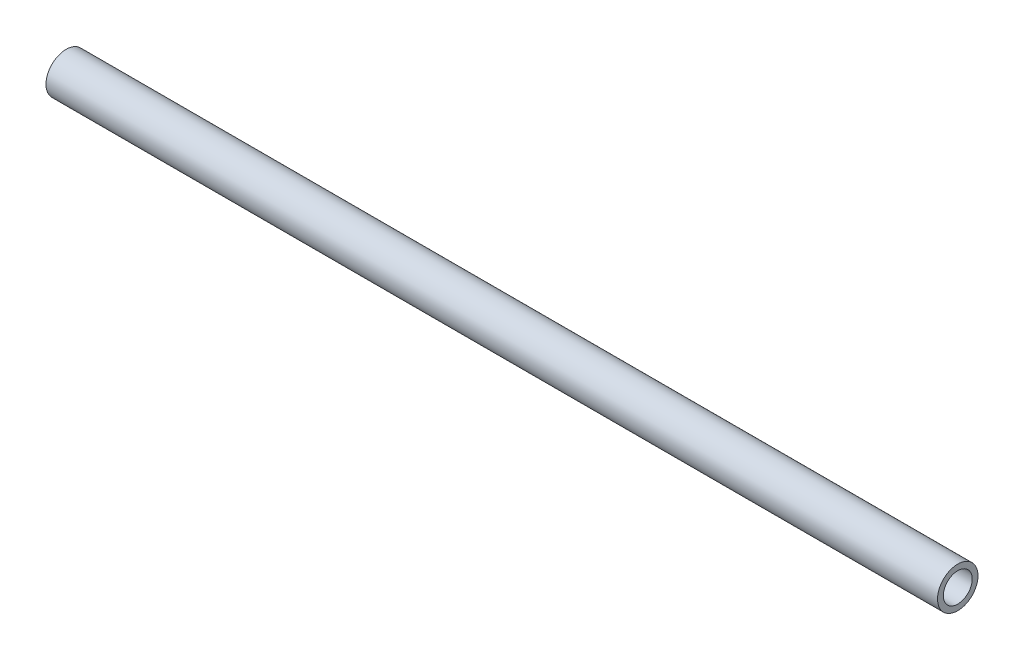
ISO-10303-21;
HEADER;
FILE_DESCRIPTION(('STEP AP214'),'2;1');
FILE_NAME('part.step','',(''),(''),'','','');
FILE_SCHEMA(('AUTOMOTIVE_DESIGN { 1 0 10303 214 1 1 1 1 }'));
ENDSEC;
DATA;
#1=APPLICATION_CONTEXT('core data for automotive mechanical design processes');
#2=APPLICATION_PROTOCOL_DEFINITION('international standard','automotive_design',2000,#1);
#3=PRODUCT_CONTEXT('',#1,'mechanical');
#4=PRODUCT('Part','Part','',(#3));
#5=PRODUCT_RELATED_PRODUCT_CATEGORY('part','',(#4));
#6=PRODUCT_DEFINITION_FORMATION('','',#4);
#7=PRODUCT_DEFINITION_CONTEXT('part definition',#1,'design');
#8=PRODUCT_DEFINITION('design','',#6,#7);
#9=PRODUCT_DEFINITION_SHAPE('','',#8);
#10=(LENGTH_UNIT() NAMED_UNIT(*) SI_UNIT(.MILLI.,.METRE.));
#11=(NAMED_UNIT(*) PLANE_ANGLE_UNIT() SI_UNIT($,.RADIAN.));
#12=(NAMED_UNIT(*) SI_UNIT($,.STERADIAN.) SOLID_ANGLE_UNIT());
#13=UNCERTAINTY_MEASURE_WITH_UNIT(LENGTH_MEASURE(1.E-05),#10,'distance_accuracy_value','');
#14=(GEOMETRIC_REPRESENTATION_CONTEXT(3) GLOBAL_UNCERTAINTY_ASSIGNED_CONTEXT((#13)) GLOBAL_UNIT_ASSIGNED_CONTEXT((#10,
#11,#12)) REPRESENTATION_CONTEXT('',''));
#15=CARTESIAN_POINT('',(0.,0.,0.));
#16=DIRECTION('',(0.,0.,1.));
#17=DIRECTION('',(1.,0.,0.));
#18=AXIS2_PLACEMENT_3D('',#15,#16,#17);
#19=CARTESIAN_POINT('',(469.9,0.,0.));
#20=DIRECTION('',(-1.,0.,0.));
#21=DIRECTION('',(0.,0.,1.));
#22=AXIS2_PLACEMENT_3D('',#19,#20,#21);
#23=CYLINDRICAL_SURFACE('',#22,7.62);
#24=CARTESIAN_POINT('',(469.9,0.,0.));
#25=DIRECTION('',(1.,0.,0.));
#26=DIRECTION('',(0.,0.,-1.));
#27=AXIS2_PLACEMENT_3D('',#24,#25,#26);
#28=CIRCLE('',#27,7.62);
#29=CARTESIAN_POINT('',(469.9,0.,-7.62));
#30=VERTEX_POINT('',#29);
#31=EDGE_CURVE('E53',#30,#30,#28,.T.);
#32=ORIENTED_EDGE('',*,*,#31,.T.);
#33=EDGE_LOOP('',(#32));
#34=FACE_BOUND('',#33,.T.);
#35=CARTESIAN_POINT('',(0.,0.,0.));
#36=DIRECTION('',(1.,0.,0.));
#37=DIRECTION('',(0.,0.,-1.));
#38=AXIS2_PLACEMENT_3D('',#35,#36,#37);
#39=CIRCLE('',#38,7.62);
#40=CARTESIAN_POINT('',(0.,0.,-7.62));
#41=VERTEX_POINT('',#40);
#42=EDGE_CURVE('E60',#41,#41,#39,.T.);
#43=ORIENTED_EDGE('',*,*,#42,.F.);
#44=EDGE_LOOP('',(#43));
#45=FACE_BOUND('',#44,.T.);
#46=ADVANCED_FACE('F45',(#34,#45),#23,.F.);
#47=CARTESIAN_POINT('',(469.9,0.,0.));
#48=DIRECTION('',(-1.,0.,0.));
#49=DIRECTION('',(0.,0.,1.));
#50=AXIS2_PLACEMENT_3D('',#47,#48,#49);
#51=CYLINDRICAL_SURFACE('',#50,10.668);
#52=CARTESIAN_POINT('',(469.9,0.,0.));
#53=DIRECTION('',(1.,0.,0.));
#54=DIRECTION('',(0.,0.,-1.));
#55=AXIS2_PLACEMENT_3D('',#52,#53,#54);
#56=CIRCLE('',#55,10.668);
#57=CARTESIAN_POINT('',(469.9,0.,-10.668));
#58=VERTEX_POINT('',#57);
#59=EDGE_CURVE('E10',#58,#58,#56,.T.);
#60=ORIENTED_EDGE('',*,*,#59,.F.);
#61=EDGE_LOOP('',(#60));
#62=FACE_BOUND('',#61,.T.);
#63=CARTESIAN_POINT('',(0.,0.,0.));
#64=DIRECTION('',(1.,0.,0.));
#65=DIRECTION('',(0.,0.,-1.));
#66=AXIS2_PLACEMENT_3D('',#63,#64,#65);
#67=CIRCLE('',#66,10.668);
#68=CARTESIAN_POINT('',(0.,0.,-10.668));
#69=VERTEX_POINT('',#68);
#70=EDGE_CURVE('E48',#69,#69,#67,.T.);
#71=ORIENTED_EDGE('',*,*,#70,.T.);
#72=EDGE_LOOP('',(#71));
#73=FACE_BOUND('',#72,.T.);
#74=ADVANCED_FACE('F69',(#62,#73),#51,.T.);
#75=CARTESIAN_POINT('',(469.9,0.,0.));
#76=DIRECTION('',(1.,0.,0.));
#77=DIRECTION('',(0.,0.,-1.));
#78=AXIS2_PLACEMENT_3D('',#75,#76,#77);
#79=PLANE('',#78);
#80=ORIENTED_EDGE('',*,*,#31,.F.);
#81=EDGE_LOOP('',(#80));
#82=FACE_BOUND('',#81,.T.);
#83=ORIENTED_EDGE('',*,*,#59,.T.);
#84=EDGE_LOOP('',(#83));
#85=FACE_BOUND('',#84,.T.);
#86=ADVANCED_FACE('F73',(#82,#85),#79,.T.);
#87=CARTESIAN_POINT('',(0.,0.,0.));
#88=DIRECTION('',(1.,0.,0.));
#89=DIRECTION('',(0.,0.,-1.));
#90=AXIS2_PLACEMENT_3D('',#87,#88,#89);
#91=PLANE('',#90);
#92=ORIENTED_EDGE('',*,*,#42,.T.);
#93=EDGE_LOOP('',(#92));
#94=FACE_BOUND('',#93,.T.);
#95=ORIENTED_EDGE('',*,*,#70,.F.);
#96=EDGE_LOOP('',(#95));
#97=FACE_BOUND('',#96,.T.);
#98=ADVANCED_FACE('F71',(#94,#97),#91,.F.);
#99=CLOSED_SHELL('',(#46,#74,#86,#98));
#100=MANIFOLD_SOLID_BREP('B2',#99);
#101=ADVANCED_BREP_SHAPE_REPRESENTATION('',(#18,#100),#14);
#102=SHAPE_DEFINITION_REPRESENTATION(#9,#101);
ENDSEC;
END-ISO-10303-21;
